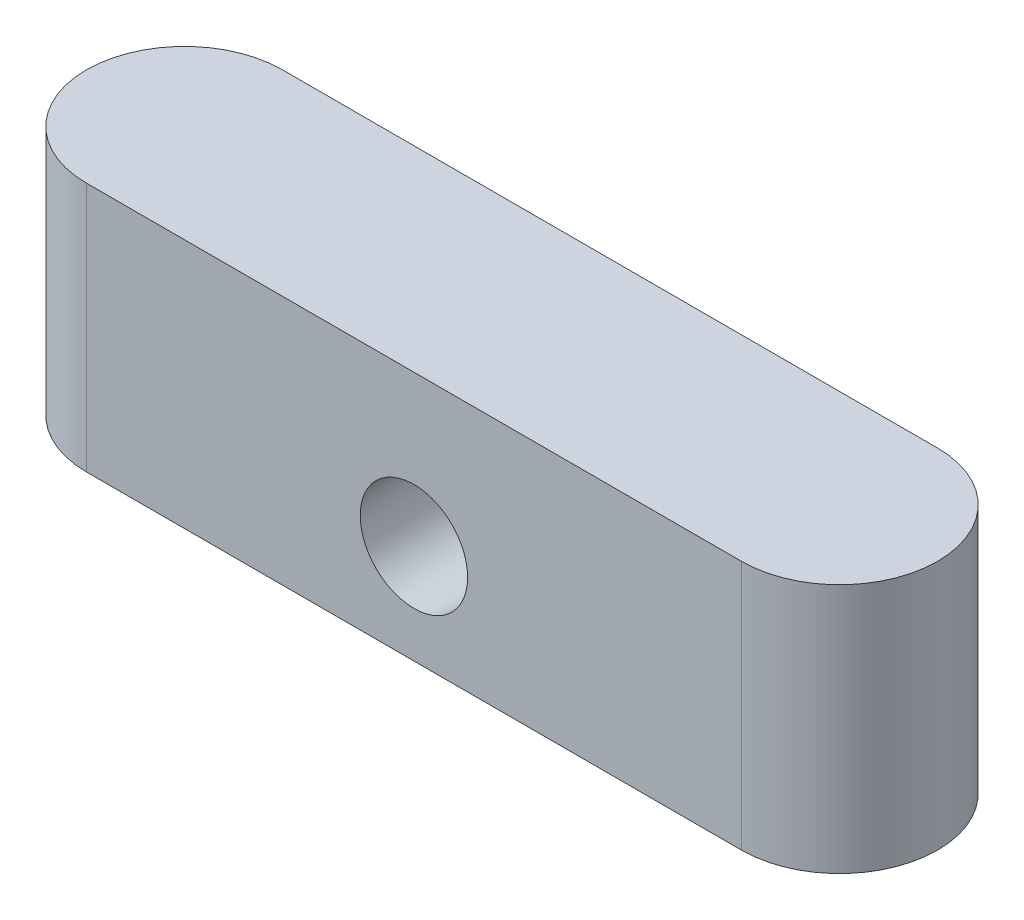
ISO-10303-21;
HEADER;
FILE_DESCRIPTION(('STEP AP214'),'2;1');
FILE_NAME('part.step','',(''),(''),'','','');
FILE_SCHEMA(('AUTOMOTIVE_DESIGN { 1 0 10303 214 1 1 1 1 }'));
ENDSEC;
DATA;
#1=APPLICATION_CONTEXT('core data for automotive mechanical design processes');
#2=APPLICATION_PROTOCOL_DEFINITION('international standard','automotive_design',2000,#1);
#3=PRODUCT_CONTEXT('',#1,'mechanical');
#4=PRODUCT('Part','Part','',(#3));
#5=PRODUCT_RELATED_PRODUCT_CATEGORY('part','',(#4));
#6=PRODUCT_DEFINITION_FORMATION('','',#4);
#7=PRODUCT_DEFINITION_CONTEXT('part definition',#1,'design');
#8=PRODUCT_DEFINITION('design','',#6,#7);
#9=PRODUCT_DEFINITION_SHAPE('','',#8);
#10=(LENGTH_UNIT() NAMED_UNIT(*) SI_UNIT(.MILLI.,.METRE.));
#11=(NAMED_UNIT(*) PLANE_ANGLE_UNIT() SI_UNIT($,.RADIAN.));
#12=(NAMED_UNIT(*) SI_UNIT($,.STERADIAN.) SOLID_ANGLE_UNIT());
#13=UNCERTAINTY_MEASURE_WITH_UNIT(LENGTH_MEASURE(1.E-05),#10,'distance_accuracy_value','');
#14=(GEOMETRIC_REPRESENTATION_CONTEXT(3) GLOBAL_UNCERTAINTY_ASSIGNED_CONTEXT((#13)) GLOBAL_UNIT_ASSIGNED_CONTEXT((#10,
#11,#12)) REPRESENTATION_CONTEXT('',''));
#15=CARTESIAN_POINT('',(0.,0.,0.));
#16=DIRECTION('',(0.,0.,1.));
#17=DIRECTION('',(1.,0.,0.));
#18=AXIS2_PLACEMENT_3D('',#15,#16,#17);
#19=CARTESIAN_POINT('',(-8.25,3.15,0.));
#20=DIRECTION('',(0.,-1.,0.));
#21=DIRECTION('',(0.,0.,-1.));
#22=AXIS2_PLACEMENT_3D('',#19,#20,#21);
#23=CYLINDRICAL_SURFACE('',#22,2.47015);
#24=CARTESIAN_POINT('',(-8.25,-3.15,0.));
#25=DIRECTION('',(0.,1.,0.));
#26=DIRECTION('',(0.,0.,1.));
#27=AXIS2_PLACEMENT_3D('',#24,#25,#26);
#28=CIRCLE('',#27,2.47015);
#29=CARTESIAN_POINT('',(-8.25,-3.15,-2.47015));
#30=VERTEX_POINT('',#29);
#31=CARTESIAN_POINT('',(-8.25,-3.15,2.47015));
#32=VERTEX_POINT('',#31);
#33=EDGE_CURVE('E97',#30,#32,#28,.T.);
#34=ORIENTED_EDGE('',*,*,#33,.T.);
#35=DIRECTION('',(0.,-1.,0.));
#36=VECTOR('',#35,1.);
#37=CARTESIAN_POINT('',(-8.25,3.15,2.47015));
#38=LINE('',#37,#36);
#39=CARTESIAN_POINT('',(-8.25,3.15,2.47015));
#40=VERTEX_POINT('',#39);
#41=EDGE_CURVE('E11',#40,#32,#38,.T.);
#42=ORIENTED_EDGE('',*,*,#41,.F.);
#43=CARTESIAN_POINT('',(-8.25,3.15,0.));
#44=DIRECTION('',(0.,1.,0.));
#45=DIRECTION('',(0.,0.,1.));
#46=AXIS2_PLACEMENT_3D('',#43,#44,#45);
#47=CIRCLE('',#46,2.47015);
#48=CARTESIAN_POINT('',(-8.25,3.15,-2.47015));
#49=VERTEX_POINT('',#48);
#50=EDGE_CURVE('E85',#49,#40,#47,.T.);
#51=ORIENTED_EDGE('',*,*,#50,.F.);
#52=DIRECTION('',(0.,-1.,0.));
#53=VECTOR('',#52,1.);
#54=CARTESIAN_POINT('',(-8.25,3.15,-2.47015));
#55=LINE('',#54,#53);
#56=EDGE_CURVE('E93',#49,#30,#55,.T.);
#57=ORIENTED_EDGE('',*,*,#56,.T.);
#58=EDGE_LOOP('',(#34,#42,#51,#57));
#59=FACE_BOUND('',#58,.T.);
#60=ADVANCED_FACE('F34',(#59),#23,.T.);
#61=CARTESIAN_POINT('',(-8.25,3.15,2.47015));
#62=DIRECTION('',(0.,0.,-1.));
#63=DIRECTION('',(-1.,0.,0.));
#64=AXIS2_PLACEMENT_3D('',#61,#62,#63);
#65=PLANE('',#64);
#66=CARTESIAN_POINT('',(0.,-0.65,2.47015));
#67=DIRECTION('',(0.,0.,1.));
#68=DIRECTION('',(1.,0.,0.));
#69=AXIS2_PLACEMENT_3D('',#66,#67,#68);
#70=CIRCLE('',#69,1.35255);
#71=CARTESIAN_POINT('',(1.35255,-0.65,2.47015));
#72=VERTEX_POINT('',#71);
#73=EDGE_CURVE('E113',#72,#72,#70,.T.);
#74=ORIENTED_EDGE('',*,*,#73,.F.);
#75=EDGE_LOOP('',(#74));
#76=FACE_BOUND('',#75,.T.);
#77=DIRECTION('',(1.,0.,0.));
#78=VECTOR('',#77,1.);
#79=CARTESIAN_POINT('',(-8.25,-3.15,2.47015));
#80=LINE('',#79,#78);
#81=CARTESIAN_POINT('',(8.25,-3.15,2.47015));
#82=VERTEX_POINT('',#81);
#83=EDGE_CURVE('E89',#32,#82,#80,.T.);
#84=ORIENTED_EDGE('',*,*,#83,.T.);
#85=DIRECTION('',(0.,-1.,0.));
#86=VECTOR('',#85,1.);
#87=CARTESIAN_POINT('',(8.25,3.15,2.47015));
#88=LINE('',#87,#86);
#89=CARTESIAN_POINT('',(8.25,3.15,2.47015));
#90=VERTEX_POINT('',#89);
#91=EDGE_CURVE('E42',#90,#82,#88,.T.);
#92=ORIENTED_EDGE('',*,*,#91,.F.);
#93=DIRECTION('',(1.,0.,0.));
#94=VECTOR('',#93,1.);
#95=CARTESIAN_POINT('',(-8.25,3.15,2.47015));
#96=LINE('',#95,#94);
#97=EDGE_CURVE('E80',#40,#90,#96,.T.);
#98=ORIENTED_EDGE('',*,*,#97,.F.);
#99=ORIENTED_EDGE('',*,*,#41,.T.);
#100=EDGE_LOOP('',(#84,#92,#98,#99));
#101=FACE_BOUND('',#100,.T.);
#102=ADVANCED_FACE('F88',(#76,#101),#65,.F.);
#103=CARTESIAN_POINT('',(8.25,3.15,0.));
#104=DIRECTION('',(0.,-1.,0.));
#105=DIRECTION('',(0.,0.,-1.));
#106=AXIS2_PLACEMENT_3D('',#103,#104,#105);
#107=CYLINDRICAL_SURFACE('',#106,2.47015);
#108=CARTESIAN_POINT('',(8.25,-3.15,0.));
#109=DIRECTION('',(0.,1.,0.));
#110=DIRECTION('',(0.,0.,1.));
#111=AXIS2_PLACEMENT_3D('',#108,#109,#110);
#112=CIRCLE('',#111,2.47015);
#113=CARTESIAN_POINT('',(8.25,-3.15,-2.47015));
#114=VERTEX_POINT('',#113);
#115=EDGE_CURVE('E67',#82,#114,#112,.T.);
#116=ORIENTED_EDGE('',*,*,#115,.T.);
#117=DIRECTION('',(0.,-1.,0.));
#118=VECTOR('',#117,1.);
#119=CARTESIAN_POINT('',(8.25,3.15,-2.47015));
#120=LINE('',#119,#118);
#121=CARTESIAN_POINT('',(8.25,3.15,-2.47015));
#122=VERTEX_POINT('',#121);
#123=EDGE_CURVE('E90',#122,#114,#120,.T.);
#124=ORIENTED_EDGE('',*,*,#123,.F.);
#125=CARTESIAN_POINT('',(8.25,3.15,0.));
#126=DIRECTION('',(0.,1.,0.));
#127=DIRECTION('',(0.,0.,1.));
#128=AXIS2_PLACEMENT_3D('',#125,#126,#127);
#129=CIRCLE('',#128,2.47015);
#130=EDGE_CURVE('E83',#90,#122,#129,.T.);
#131=ORIENTED_EDGE('',*,*,#130,.F.);
#132=ORIENTED_EDGE('',*,*,#91,.T.);
#133=EDGE_LOOP('',(#116,#124,#131,#132));
#134=FACE_BOUND('',#133,.T.);
#135=ADVANCED_FACE('F91',(#134),#107,.T.);
#136=CARTESIAN_POINT('',(-8.25,3.15,-2.47015));
#137=DIRECTION('',(0.,0.,1.));
#138=DIRECTION('',(1.,0.,0.));
#139=AXIS2_PLACEMENT_3D('',#136,#137,#138);
#140=PLANE('',#139);
#141=CARTESIAN_POINT('',(0.,-0.65,-2.47015));
#142=DIRECTION('',(0.,0.,1.));
#143=DIRECTION('',(1.,0.,0.));
#144=AXIS2_PLACEMENT_3D('',#141,#142,#143);
#145=CIRCLE('',#144,1.35255);
#146=CARTESIAN_POINT('',(1.35255,-0.65,-2.47015));
#147=VERTEX_POINT('',#146);
#148=EDGE_CURVE('E100',#147,#147,#145,.T.);
#149=ORIENTED_EDGE('',*,*,#148,.T.);
#150=EDGE_LOOP('',(#149));
#151=FACE_BOUND('',#150,.T.);
#152=DIRECTION('',(-1.,0.,0.));
#153=VECTOR('',#152,1.);
#154=CARTESIAN_POINT('',(-8.25,-3.15,-2.47015));
#155=LINE('',#154,#153);
#156=EDGE_CURVE('E73',#114,#30,#155,.T.);
#157=ORIENTED_EDGE('',*,*,#156,.T.);
#158=ORIENTED_EDGE('',*,*,#56,.F.);
#159=DIRECTION('',(-1.,0.,0.));
#160=VECTOR('',#159,1.);
#161=CARTESIAN_POINT('',(-8.25,3.15,-2.47015));
#162=LINE('',#161,#160);
#163=EDGE_CURVE('E50',#122,#49,#162,.T.);
#164=ORIENTED_EDGE('',*,*,#163,.F.);
#165=ORIENTED_EDGE('',*,*,#123,.T.);
#166=EDGE_LOOP('',(#157,#158,#164,#165));
#167=FACE_BOUND('',#166,.T.);
#168=ADVANCED_FACE('F105',(#151,#167),#140,.F.);
#169=CARTESIAN_POINT('',(-8.25,3.15,0.));
#170=DIRECTION('',(0.,1.,0.));
#171=DIRECTION('',(0.,0.,1.));
#172=AXIS2_PLACEMENT_3D('',#169,#170,#171);
#173=PLANE('',#172);
#174=ORIENTED_EDGE('',*,*,#50,.T.);
#175=ORIENTED_EDGE('',*,*,#97,.T.);
#176=ORIENTED_EDGE('',*,*,#130,.T.);
#177=ORIENTED_EDGE('',*,*,#163,.T.);
#178=EDGE_LOOP('',(#174,#175,#176,#177));
#179=FACE_BOUND('',#178,.T.);
#180=ADVANCED_FACE('F81',(#179),#173,.T.);
#181=CARTESIAN_POINT('',(-8.25,-3.15,0.));
#182=DIRECTION('',(0.,1.,0.));
#183=DIRECTION('',(0.,0.,1.));
#184=AXIS2_PLACEMENT_3D('',#181,#182,#183);
#185=PLANE('',#184);
#186=ORIENTED_EDGE('',*,*,#33,.F.);
#187=ORIENTED_EDGE('',*,*,#156,.F.);
#188=ORIENTED_EDGE('',*,*,#115,.F.);
#189=ORIENTED_EDGE('',*,*,#83,.F.);
#190=EDGE_LOOP('',(#186,#187,#188,#189));
#191=FACE_BOUND('',#190,.T.);
#192=ADVANCED_FACE('F108',(#191),#185,.F.);
#193=CARTESIAN_POINT('',(0.,-0.65,2.47015));
#194=DIRECTION('',(0.,0.,1.));
#195=DIRECTION('',(1.,0.,0.));
#196=AXIS2_PLACEMENT_3D('',#193,#194,#195);
#197=CYLINDRICAL_SURFACE('',#196,1.35255);
#198=ORIENTED_EDGE('',*,*,#148,.F.);
#199=EDGE_LOOP('',(#198));
#200=FACE_BOUND('',#199,.T.);
#201=ORIENTED_EDGE('',*,*,#73,.T.);
#202=EDGE_LOOP('',(#201));
#203=FACE_BOUND('',#202,.T.);
#204=ADVANCED_FACE('F117',(#200,#203),#197,.F.);
#205=CLOSED_SHELL('',(#60,#102,#135,#168,#180,#192,#204));
#206=MANIFOLD_SOLID_BREP('B2',#205);
#207=ADVANCED_BREP_SHAPE_REPRESENTATION('',(#18,#206),#14);
#208=SHAPE_DEFINITION_REPRESENTATION(#9,#207);
ENDSEC;
END-ISO-10303-21;
